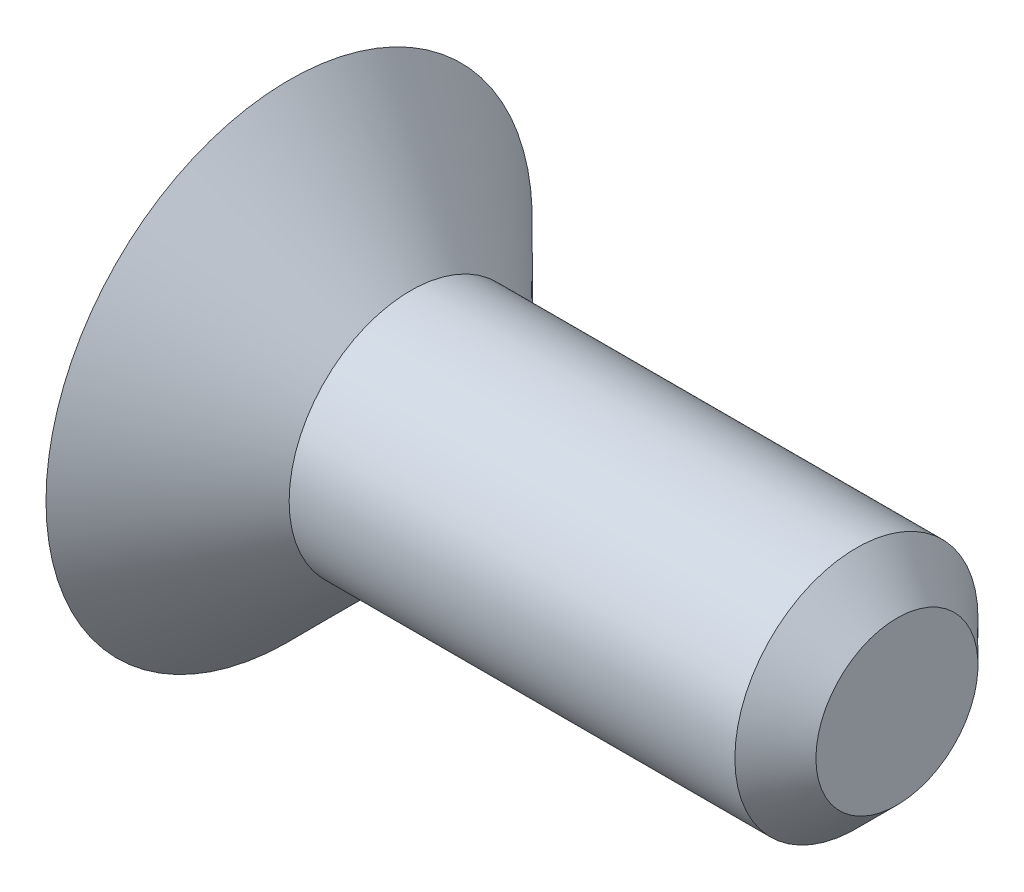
from build123d import *

# Parameters (mm, degrees)
ENL_V_MAT_EXTRU_3_DEPTH = 2


with BuildPart() as part:
    # Esquisse1 → Base-R_volution (revolve)
    with BuildSketch(Plane.XY, mode=Mode.PRIVATE) as base_r_volution_sk:
        Polygon((1.5, 1.5), (7, 1.5), (7.5, 1), (7.5, 0), (0, 0), (0, 3), align=None)
    revolve(base_r_volution_sk.sketch.rotate(Axis((-5.068209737, 0, 0), (1, 0, 0)), 90), axis=Axis((-5.068209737, 0, 0), (1, 0, 0)))

    # Esquisse4 → Enl_v. mat.-Extru.3 (cut)
    with BuildSketch(Plane.ZY):
        Polygon((0, -1.443375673), (1.25, -0.721687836), (1.25, 0.721687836), (0, 1.443375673), (-1.25, 0.721687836), (-1.25, -0.721687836), align=None)
    extrude(amount=-ENL_V_MAT_EXTRU_3_DEPTH, mode=Mode.SUBTRACT)


solid = part.part
